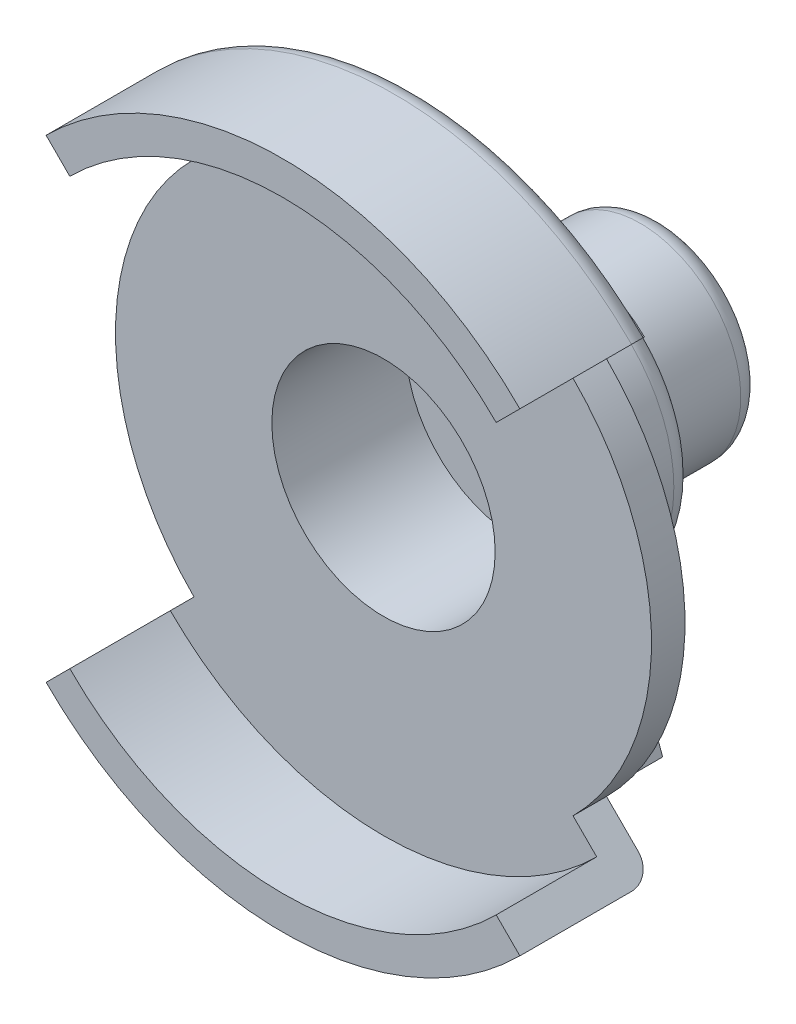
ISO-10303-21;
HEADER;
FILE_DESCRIPTION(('STEP AP214'),'2;1');
FILE_NAME('part.step','',(''),(''),'','','');
FILE_SCHEMA(('AUTOMOTIVE_DESIGN { 1 0 10303 214 1 1 1 1 }'));
ENDSEC;
DATA;
#1=APPLICATION_CONTEXT('core data for automotive mechanical design processes');
#2=APPLICATION_PROTOCOL_DEFINITION('international standard','automotive_design',2000,#1);
#3=PRODUCT_CONTEXT('',#1,'mechanical');
#4=PRODUCT('Part','Part','',(#3));
#5=PRODUCT_RELATED_PRODUCT_CATEGORY('part','',(#4));
#6=PRODUCT_DEFINITION_FORMATION('','',#4);
#7=PRODUCT_DEFINITION_CONTEXT('part definition',#1,'design');
#8=PRODUCT_DEFINITION('design','',#6,#7);
#9=PRODUCT_DEFINITION_SHAPE('','',#8);
#10=(LENGTH_UNIT() NAMED_UNIT(*) SI_UNIT(.MILLI.,.METRE.));
#11=(NAMED_UNIT(*) PLANE_ANGLE_UNIT() SI_UNIT($,.RADIAN.));
#12=(NAMED_UNIT(*) SI_UNIT($,.STERADIAN.) SOLID_ANGLE_UNIT());
#13=UNCERTAINTY_MEASURE_WITH_UNIT(LENGTH_MEASURE(1.E-05),#10,'distance_accuracy_value','');
#14=(GEOMETRIC_REPRESENTATION_CONTEXT(3) GLOBAL_UNCERTAINTY_ASSIGNED_CONTEXT((#13)) GLOBAL_UNIT_ASSIGNED_CONTEXT((#10,
#11,#12)) REPRESENTATION_CONTEXT('',''));
#15=CARTESIAN_POINT('',(0.,0.,0.));
#16=DIRECTION('',(0.,0.,1.));
#17=DIRECTION('',(1.,0.,0.));
#18=AXIS2_PLACEMENT_3D('',#15,#16,#17);
#19=CARTESIAN_POINT('',(0.,0.,-3.));
#20=DIRECTION('',(0.,0.,1.));
#21=DIRECTION('',(1.,0.,0.));
#22=AXIS2_PLACEMENT_3D('',#19,#20,#21);
#23=PLANE('',#22);
#24=CARTESIAN_POINT('',(0.,0.,-3.));
#25=DIRECTION('',(0.,0.,1.));
#26=DIRECTION('',(1.,0.,0.));
#27=AXIS2_PLACEMENT_3D('',#24,#25,#26);
#28=CIRCLE('',#27,6.5);
#29=CARTESIAN_POINT('',(6.5,0.,-3.));
#30=VERTEX_POINT('',#29);
#31=EDGE_CURVE('E389',#30,#30,#28,.F.);
#32=ORIENTED_EDGE('',*,*,#31,.F.);
#33=EDGE_LOOP('',(#32));
#34=FACE_BOUND('',#33,.T.);
#35=CARTESIAN_POINT('',(0.,0.,-3.));
#36=DIRECTION('',(0.,0.,1.));
#37=DIRECTION('',(1.,0.,0.));
#38=AXIS2_PLACEMENT_3D('',#35,#36,#37);
#39=CIRCLE('',#38,14.);
#40=CARTESIAN_POINT('',(-9.89949493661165,9.89949493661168,-3.));
#41=VERTEX_POINT('',#40);
#42=CARTESIAN_POINT('',(9.89949493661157,9.89949493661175,-3.));
#43=VERTEX_POINT('',#42);
#44=EDGE_CURVE('E409',#41,#43,#39,.F.);
#45=ORIENTED_EDGE('',*,*,#44,.T.);
#46=DIRECTION('',(0.707106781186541,0.707106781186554,0.));
#47=VECTOR('',#46,1.);
#48=CARTESIAN_POINT('',(8.48528137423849,8.48528137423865,-3.));
#49=LINE('',#48,#47);
#50=CARTESIAN_POINT('',(8.48528137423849,8.48528137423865,-3.));
#51=VERTEX_POINT('',#50);
#52=EDGE_CURVE('E258',#51,#43,#49,.T.);
#53=ORIENTED_EDGE('',*,*,#52,.F.);
#54=CARTESIAN_POINT('',(0.,0.,-3.));
#55=DIRECTION('',(0.,0.,1.));
#56=DIRECTION('',(1.,0.,0.));
#57=AXIS2_PLACEMENT_3D('',#54,#55,#56);
#58=CIRCLE('',#57,12.);
#59=CARTESIAN_POINT('',(8.48528137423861,-8.48528137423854,-3.));
#60=VERTEX_POINT('',#59);
#61=EDGE_CURVE('E255',#60,#51,#58,.T.);
#62=ORIENTED_EDGE('',*,*,#61,.F.);
#63=DIRECTION('',(-0.707106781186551,0.707106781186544,0.));
#64=VECTOR('',#63,1.);
#65=CARTESIAN_POINT('',(8.48528137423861,-8.48528137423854,-3.));
#66=LINE('',#65,#64);
#67=CARTESIAN_POINT('',(9.89949493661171,-9.89949493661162,-3.));
#68=VERTEX_POINT('',#67);
#69=EDGE_CURVE('E224',#68,#60,#66,.T.);
#70=ORIENTED_EDGE('',*,*,#69,.F.);
#71=CARTESIAN_POINT('',(-9.89949493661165,-9.89949493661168,-3.));
#72=VERTEX_POINT('',#71);
#73=EDGE_CURVE('E408',#68,#72,#39,.F.);
#74=ORIENTED_EDGE('',*,*,#73,.T.);
#75=DIRECTION('',(-0.707106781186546,-0.707106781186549,0.));
#76=VECTOR('',#75,1.);
#77=CARTESIAN_POINT('',(-8.48528137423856,-8.48528137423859,-3.));
#78=LINE('',#77,#76);
#79=CARTESIAN_POINT('',(-8.48528137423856,-8.4852813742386,-3.));
#80=VERTEX_POINT('',#79);
#81=EDGE_CURVE('E288',#80,#72,#78,.T.);
#82=ORIENTED_EDGE('',*,*,#81,.F.);
#83=CARTESIAN_POINT('',(0.,0.,-3.));
#84=DIRECTION('',(0.,0.,1.));
#85=DIRECTION('',(-1.,0.,0.));
#86=AXIS2_PLACEMENT_3D('',#83,#84,#85);
#87=CIRCLE('',#86,12.);
#88=CARTESIAN_POINT('',(-8.48528137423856,8.48528137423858,-3.));
#89=VERTEX_POINT('',#88);
#90=EDGE_CURVE('E285',#89,#80,#87,.T.);
#91=ORIENTED_EDGE('',*,*,#90,.F.);
#92=DIRECTION('',(0.707106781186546,-0.707106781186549,0.));
#93=VECTOR('',#92,1.);
#94=CARTESIAN_POINT('',(-8.48528137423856,8.48528137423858,-3.));
#95=LINE('',#94,#93);
#96=EDGE_CURVE('E282',#41,#89,#95,.T.);
#97=ORIENTED_EDGE('',*,*,#96,.F.);
#98=EDGE_LOOP('',(#45,#53,#62,#70,#74,#82,#91,#97));
#99=FACE_BOUND('',#98,.T.);
#100=CARTESIAN_POINT('',(0.,0.,-3.));
#101=DIRECTION('',(0.,0.,-1.));
#102=DIRECTION('',(-1.,0.,0.));
#103=AXIS2_PLACEMENT_3D('',#100,#101,#102);
#104=CIRCLE('',#103,13.);
#105=CARTESIAN_POINT('',(4.49999999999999,-12.1963109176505,-3.));
#106=VERTEX_POINT('',#105);
#107=CARTESIAN_POINT('',(-4.50000000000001,-12.1963109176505,-3.));
#108=VERTEX_POINT('',#107);
#109=EDGE_CURVE('E228',#106,#108,#104,.T.);
#110=ORIENTED_EDGE('',*,*,#109,.F.);
#111=DIRECTION('',(-0.346153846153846,0.93817776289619,0.));
#112=VECTOR('',#111,1.);
#113=CARTESIAN_POINT('',(4.49999999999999,-12.1963109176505,-3.));
#114=LINE('',#113,#112);
#115=CARTESIAN_POINT('',(3.8076923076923,-10.3199553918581,-3.));
#116=VERTEX_POINT('',#115);
#117=EDGE_CURVE('E236',#106,#116,#114,.T.);
#118=ORIENTED_EDGE('',*,*,#117,.T.);
#119=CARTESIAN_POINT('',(0.,0.,-3.));
#120=DIRECTION('',(0.,0.,-1.));
#121=DIRECTION('',(-1.,0.,0.));
#122=AXIS2_PLACEMENT_3D('',#119,#120,#121);
#123=CIRCLE('',#122,11.);
#124=CARTESIAN_POINT('',(-3.80769230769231,-10.3199553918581,-3.));
#125=VERTEX_POINT('',#124);
#126=EDGE_CURVE('E50',#116,#125,#123,.T.);
#127=ORIENTED_EDGE('',*,*,#126,.T.);
#128=DIRECTION('',(-0.346153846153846,-0.93817776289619,0.));
#129=VECTOR('',#128,1.);
#130=CARTESIAN_POINT('',(-3.80769230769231,-10.3199553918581,-3.));
#131=LINE('',#130,#129);
#132=EDGE_CURVE('E219',#125,#108,#131,.T.);
#133=ORIENTED_EDGE('',*,*,#132,.T.);
#134=EDGE_LOOP('',(#110,#118,#127,#133));
#135=FACE_BOUND('',#134,.T.);
#136=ADVANCED_FACE('F35',(#34,#99,#135),#23,.F.);
#137=CARTESIAN_POINT('',(0.,0.,3.));
#138=DIRECTION('',(0.,0.,-1.));
#139=DIRECTION('',(-1.,0.,0.));
#140=AXIS2_PLACEMENT_3D('',#137,#138,#139);
#141=CYLINDRICAL_SURFACE('',#140,15.);
#142=CARTESIAN_POINT('',(0.,0.,3.));
#143=DIRECTION('',(0.,0.,1.));
#144=DIRECTION('',(1.,0.,0.));
#145=AXIS2_PLACEMENT_3D('',#142,#143,#144);
#146=CIRCLE('',#145,15.);
#147=CARTESIAN_POINT('',(10.6066017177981,10.6066017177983,3.));
#148=VERTEX_POINT('',#147);
#149=CARTESIAN_POINT('',(-10.6066017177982,10.6066017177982,3.));
#150=VERTEX_POINT('',#149);
#151=EDGE_CURVE('E385',#148,#150,#146,.T.);
#152=ORIENTED_EDGE('',*,*,#151,.F.);
#153=DIRECTION('',(0.,0.,-1.));
#154=VECTOR('',#153,1.);
#155=CARTESIAN_POINT('',(10.6066017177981,10.6066017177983,3.));
#156=LINE('',#155,#154);
#157=CARTESIAN_POINT('',(10.6066017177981,10.6066017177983,-2.));
#158=VERTEX_POINT('',#157);
#159=EDGE_CURVE('E267',#148,#158,#156,.T.);
#160=ORIENTED_EDGE('',*,*,#159,.T.);
#161=CARTESIAN_POINT('',(0.,0.,-2.));
#162=DIRECTION('',(0.,0.,1.));
#163=DIRECTION('',(1.,0.,0.));
#164=AXIS2_PLACEMENT_3D('',#161,#162,#163);
#165=CIRCLE('',#164,15.);
#166=CARTESIAN_POINT('',(-10.6066017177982,10.6066017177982,-2.));
#167=VERTEX_POINT('',#166);
#168=EDGE_CURVE('E404',#158,#167,#165,.T.);
#169=ORIENTED_EDGE('',*,*,#168,.T.);
#170=DIRECTION('',(0.,0.,-1.));
#171=VECTOR('',#170,1.);
#172=CARTESIAN_POINT('',(-10.6066017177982,10.6066017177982,3.));
#173=LINE('',#172,#171);
#174=EDGE_CURVE('E297',#150,#167,#173,.T.);
#175=ORIENTED_EDGE('',*,*,#174,.F.);
#176=EDGE_LOOP('',(#152,#160,#169,#175));
#177=FACE_BOUND('',#176,.T.);
#178=ADVANCED_FACE('F454',(#177),#141,.T.);
#179=CARTESIAN_POINT('',(0.,0.,3.));
#180=DIRECTION('',(0.,0.,1.));
#181=DIRECTION('',(1.,0.,0.));
#182=AXIS2_PLACEMENT_3D('',#179,#180,#181);
#183=PLANE('',#182);
#184=DIRECTION('',(0.707106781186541,0.707106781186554,0.));
#185=VECTOR('',#184,1.);
#186=CARTESIAN_POINT('',(8.48528137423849,8.48528137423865,3.));
#187=LINE('',#186,#185);
#188=CARTESIAN_POINT('',(9.54594154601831,9.54594154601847,3.));
#189=VERTEX_POINT('',#188);
#190=EDGE_CURVE('E263',#189,#148,#187,.T.);
#191=ORIENTED_EDGE('',*,*,#190,.T.);
#192=ORIENTED_EDGE('',*,*,#151,.T.);
#193=DIRECTION('',(0.707106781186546,-0.707106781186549,0.));
#194=VECTOR('',#193,1.);
#195=CARTESIAN_POINT('',(-8.48528137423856,8.48528137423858,3.));
#196=LINE('',#195,#194);
#197=CARTESIAN_POINT('',(-9.54594154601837,9.54594154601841,3.));
#198=VERTEX_POINT('',#197);
#199=EDGE_CURVE('E291',#150,#198,#196,.T.);
#200=ORIENTED_EDGE('',*,*,#199,.T.);
#201=CARTESIAN_POINT('',(0.,0.,3.));
#202=DIRECTION('',(0.,0.,1.));
#203=DIRECTION('',(1.,0.,0.));
#204=AXIS2_PLACEMENT_3D('',#201,#202,#203);
#205=CIRCLE('',#204,13.5);
#206=EDGE_CURVE('E373',#189,#198,#205,.T.);
#207=ORIENTED_EDGE('',*,*,#206,.F.);
#208=EDGE_LOOP('',(#191,#192,#200,#207));
#209=FACE_BOUND('',#208,.T.);
#210=ADVANCED_FACE('F451',(#209),#183,.T.);
#211=CARTESIAN_POINT('',(0.,0.,-2.));
#212=DIRECTION('',(0.,0.,1.));
#213=DIRECTION('',(1.,0.,0.));
#214=AXIS2_PLACEMENT_3D('',#211,#212,#213);
#215=TOROIDAL_SURFACE('',#214,14.,1.);
#216=CARTESIAN_POINT('',(9.89949493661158,9.89949493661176,-2.));
#217=DIRECTION('',(-0.707106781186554,0.707106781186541,0.));
#218=DIRECTION('',(-0.707106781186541,-0.707106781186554,0.));
#219=AXIS2_PLACEMENT_3D('',#216,#217,#218);
#220=CIRCLE('',#219,1.);
#221=EDGE_CURVE('E280',#43,#158,#220,.F.);
#222=ORIENTED_EDGE('',*,*,#221,.F.);
#223=ORIENTED_EDGE('',*,*,#44,.F.);
#224=CARTESIAN_POINT('',(-9.89949493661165,9.89949493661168,-2.));
#225=DIRECTION('',(0.707106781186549,0.707106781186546,0.));
#226=DIRECTION('',(-0.707106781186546,0.707106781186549,0.));
#227=AXIS2_PLACEMENT_3D('',#224,#225,#226);
#228=CIRCLE('',#227,1.);
#229=EDGE_CURVE('E310',#167,#41,#228,.F.);
#230=ORIENTED_EDGE('',*,*,#229,.F.);
#231=ORIENTED_EDGE('',*,*,#168,.F.);
#232=EDGE_LOOP('',(#222,#223,#230,#231));
#233=FACE_BOUND('',#232,.T.);
#234=ADVANCED_FACE('F461',(#233),#215,.T.);
#235=CARTESIAN_POINT('',(0.,0.,3.));
#236=DIRECTION('',(0.,0.,-1.));
#237=DIRECTION('',(-1.,0.,0.));
#238=AXIS2_PLACEMENT_3D('',#235,#236,#237);
#239=CYLINDRICAL_SURFACE('',#238,13.5);
#240=DIRECTION('',(0.,0.,-1.));
#241=VECTOR('',#240,1.);
#242=CARTESIAN_POINT('',(9.54594154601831,9.54594154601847,3.));
#243=LINE('',#242,#241);
#244=CARTESIAN_POINT('',(9.54594154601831,9.54594154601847,-1.5));
#245=VERTEX_POINT('',#244);
#246=EDGE_CURVE('E43',#189,#245,#243,.T.);
#247=ORIENTED_EDGE('',*,*,#246,.F.);
#248=ORIENTED_EDGE('',*,*,#206,.T.);
#249=DIRECTION('',(0.,0.,-1.));
#250=VECTOR('',#249,1.);
#251=CARTESIAN_POINT('',(-9.54594154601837,9.54594154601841,3.));
#252=LINE('',#251,#250);
#253=CARTESIAN_POINT('',(-9.54594154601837,9.54594154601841,-1.5));
#254=VERTEX_POINT('',#253);
#255=EDGE_CURVE('E422',#254,#198,#252,.F.);
#256=ORIENTED_EDGE('',*,*,#255,.F.);
#257=CARTESIAN_POINT('',(0.,0.,-1.5));
#258=DIRECTION('',(0.,0.,1.));
#259=DIRECTION('',(1.,0.,0.));
#260=AXIS2_PLACEMENT_3D('',#257,#258,#259);
#261=CIRCLE('',#260,13.5);
#262=EDGE_CURVE('E369',#245,#254,#261,.T.);
#263=ORIENTED_EDGE('',*,*,#262,.F.);
#264=EDGE_LOOP('',(#247,#248,#256,#263));
#265=FACE_BOUND('',#264,.T.);
#266=ADVANCED_FACE('F444',(#265),#239,.F.);
#267=CARTESIAN_POINT('',(0.,0.,-8.99999999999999));
#268=DIRECTION('',(0.,0.,-1.));
#269=DIRECTION('',(-1.,0.,0.));
#270=AXIS2_PLACEMENT_3D('',#267,#268,#269);
#271=PLANE('',#270);
#272=DIRECTION('',(-0.707106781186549,-0.707106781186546,0.));
#273=VECTOR('',#272,1.);
#274=CARTESIAN_POINT('',(0.,0.,-8.99999999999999));
#275=LINE('',#274,#273);
#276=CARTESIAN_POINT('',(3.88908729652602,3.889087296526,-8.99999999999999));
#277=VERTEX_POINT('',#276);
#278=CARTESIAN_POINT('',(3.18198051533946,3.18198051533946,-8.99999999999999));
#279=VERTEX_POINT('',#278);
#280=EDGE_CURVE('E357',#277,#279,#275,.T.);
#281=ORIENTED_EDGE('',*,*,#280,.F.);
#282=CARTESIAN_POINT('',(0.,0.,-8.99999999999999));
#283=DIRECTION('',(0.,0.,-1.));
#284=DIRECTION('',(-1.,0.,0.));
#285=AXIS2_PLACEMENT_3D('',#282,#283,#284);
#286=CIRCLE('',#285,5.5);
#287=CARTESIAN_POINT('',(-3.88908729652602,3.889087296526,-8.99999999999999));
#288=VERTEX_POINT('',#287);
#289=EDGE_CURVE('E398',#277,#288,#286,.T.);
#290=ORIENTED_EDGE('',*,*,#289,.T.);
#291=DIRECTION('',(-0.707106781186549,0.707106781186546,0.));
#292=VECTOR('',#291,1.);
#293=CARTESIAN_POINT('',(0.,0.,-8.99999999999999));
#294=LINE('',#293,#292);
#295=CARTESIAN_POINT('',(-3.18198051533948,3.18198051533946,-8.99999999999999));
#296=VERTEX_POINT('',#295);
#297=EDGE_CURVE('E345',#296,#288,#294,.T.);
#298=ORIENTED_EDGE('',*,*,#297,.F.);
#299=CARTESIAN_POINT('',(0.,0.,-8.99999999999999));
#300=DIRECTION('',(0.,0.,-1.));
#301=DIRECTION('',(-1.,0.,0.));
#302=AXIS2_PLACEMENT_3D('',#299,#300,#301);
#303=CIRCLE('',#302,4.5);
#304=EDGE_CURVE('E380',#279,#296,#303,.T.);
#305=ORIENTED_EDGE('',*,*,#304,.F.);
#306=EDGE_LOOP('',(#281,#290,#298,#305));
#307=FACE_BOUND('',#306,.T.);
#308=ADVANCED_FACE('F519',(#307),#271,.T.);
#309=CARTESIAN_POINT('',(-10.6066017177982,-10.6066017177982,-2.));
#310=VERTEX_POINT('',#309);
#311=CARTESIAN_POINT('',(10.6066017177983,-10.6066017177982,-2.));
#312=VERTEX_POINT('',#311);
#313=EDGE_CURVE('E405',#310,#312,#165,.T.);
#314=ORIENTED_EDGE('',*,*,#313,.T.);
#315=DIRECTION('',(0.,0.,-1.));
#316=VECTOR('',#315,1.);
#317=CARTESIAN_POINT('',(10.6066017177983,-10.6066017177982,3.));
#318=LINE('',#317,#316);
#319=CARTESIAN_POINT('',(10.6066017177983,-10.6066017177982,3.));
#320=VERTEX_POINT('',#319);
#321=EDGE_CURVE('E266',#320,#312,#318,.T.);
#322=ORIENTED_EDGE('',*,*,#321,.F.);
#323=CARTESIAN_POINT('',(-10.6066017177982,-10.6066017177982,3.));
#324=VERTEX_POINT('',#323);
#325=EDGE_CURVE('E386',#324,#320,#146,.T.);
#326=ORIENTED_EDGE('',*,*,#325,.F.);
#327=DIRECTION('',(0.,0.,-1.));
#328=VECTOR('',#327,1.);
#329=CARTESIAN_POINT('',(-10.6066017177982,-10.6066017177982,3.));
#330=LINE('',#329,#328);
#331=EDGE_CURVE('E298',#324,#310,#330,.T.);
#332=ORIENTED_EDGE('',*,*,#331,.T.);
#333=EDGE_LOOP('',(#314,#322,#326,#332));
#334=FACE_BOUND('',#333,.T.);
#335=ADVANCED_FACE('F37',(#334),#141,.T.);
#336=DIRECTION('',(-0.707106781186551,0.707106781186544,0.));
#337=VECTOR('',#336,1.);
#338=CARTESIAN_POINT('',(8.48528137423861,-8.48528137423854,3.));
#339=LINE('',#338,#337);
#340=CARTESIAN_POINT('',(9.54594154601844,-9.54594154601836,3.));
#341=VERTEX_POINT('',#340);
#342=EDGE_CURVE('E260',#320,#341,#339,.T.);
#343=ORIENTED_EDGE('',*,*,#342,.T.);
#344=CARTESIAN_POINT('',(-9.54594154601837,-9.54594154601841,3.));
#345=VERTEX_POINT('',#344);
#346=EDGE_CURVE('E376',#345,#341,#205,.T.);
#347=ORIENTED_EDGE('',*,*,#346,.F.);
#348=DIRECTION('',(-0.707106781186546,-0.707106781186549,0.));
#349=VECTOR('',#348,1.);
#350=CARTESIAN_POINT('',(-8.48528137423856,-8.48528137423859,3.));
#351=LINE('',#350,#349);
#352=EDGE_CURVE('E294',#345,#324,#351,.T.);
#353=ORIENTED_EDGE('',*,*,#352,.T.);
#354=ORIENTED_EDGE('',*,*,#325,.T.);
#355=EDGE_LOOP('',(#343,#347,#353,#354));
#356=FACE_BOUND('',#355,.T.);
#357=ADVANCED_FACE('F481',(#356),#183,.T.);
#358=CARTESIAN_POINT('',(0.,0.,-8.99999999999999));
#359=DIRECTION('',(0.,0.,1.));
#360=DIRECTION('',(1.,0.,0.));
#361=AXIS2_PLACEMENT_3D('',#358,#359,#360);
#362=CYLINDRICAL_SURFACE('',#361,6.5);
#363=CARTESIAN_POINT('',(0.,0.,-7.99999999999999));
#364=DIRECTION('',(0.,0.,-1.));
#365=DIRECTION('',(-1.,0.,0.));
#366=AXIS2_PLACEMENT_3D('',#363,#364,#365);
#367=CIRCLE('',#366,6.5);
#368=CARTESIAN_POINT('',(-4.59619407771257,4.59619407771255,-7.99999999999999));
#369=VERTEX_POINT('',#368);
#370=CARTESIAN_POINT('',(4.59619407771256,4.59619407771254,-7.99999999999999));
#371=VERTEX_POINT('',#370);
#372=EDGE_CURVE('E401',#369,#371,#367,.F.);
#373=ORIENTED_EDGE('',*,*,#372,.T.);
#374=DIRECTION('',(0.,0.,-1.));
#375=VECTOR('',#374,1.);
#376=CARTESIAN_POINT('',(4.59619407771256,4.59619407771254,-4.));
#377=LINE('',#376,#375);
#378=CARTESIAN_POINT('',(4.59619407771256,4.59619407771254,-4.));
#379=VERTEX_POINT('',#378);
#380=EDGE_CURVE('E331',#379,#371,#377,.T.);
#381=ORIENTED_EDGE('',*,*,#380,.F.);
#382=CARTESIAN_POINT('',(0.,0.,-4.));
#383=DIRECTION('',(0.,0.,-1.));
#384=DIRECTION('',(-1.,0.,0.));
#385=AXIS2_PLACEMENT_3D('',#382,#383,#384);
#386=CIRCLE('',#385,6.5);
#387=CARTESIAN_POINT('',(-4.59619407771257,4.59619407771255,-4.));
#388=VERTEX_POINT('',#387);
#389=EDGE_CURVE('E327',#388,#379,#386,.T.);
#390=ORIENTED_EDGE('',*,*,#389,.F.);
#391=DIRECTION('',(0.,0.,-1.));
#392=VECTOR('',#391,1.);
#393=CARTESIAN_POINT('',(-4.59619407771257,4.59619407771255,-4.));
#394=LINE('',#393,#392);
#395=EDGE_CURVE('E330',#388,#369,#394,.T.);
#396=ORIENTED_EDGE('',*,*,#395,.T.);
#397=EDGE_LOOP('',(#373,#381,#390,#396));
#398=FACE_BOUND('',#397,.T.);
#399=ORIENTED_EDGE('',*,*,#31,.T.);
#400=EDGE_LOOP('',(#399));
#401=FACE_BOUND('',#400,.T.);
#402=ADVANCED_FACE('F510',(#398,#401),#362,.T.);
#403=CARTESIAN_POINT('',(0.,0.,-14.));
#404=DIRECTION('',(0.,0.,1.));
#405=DIRECTION('',(1.,0.,0.));
#406=AXIS2_PLACEMENT_3D('',#403,#404,#405);
#407=CYLINDRICAL_SURFACE('',#406,4.5);
#408=CARTESIAN_POINT('',(0.,0.,-13.));
#409=DIRECTION('',(0.,0.,-1.));
#410=DIRECTION('',(-1.,0.,0.));
#411=AXIS2_PLACEMENT_3D('',#408,#409,#410);
#412=CIRCLE('',#411,4.5);
#413=CARTESIAN_POINT('',(-4.5,0.,-13.));
#414=VERTEX_POINT('',#413);
#415=EDGE_CURVE('E395',#414,#414,#412,.F.);
#416=ORIENTED_EDGE('',*,*,#415,.T.);
#417=EDGE_LOOP('',(#416));
#418=FACE_BOUND('',#417,.T.);
#419=CARTESIAN_POINT('',(0.,0.,-9.99999999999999));
#420=DIRECTION('',(0.,0.,-1.));
#421=DIRECTION('',(-1.,0.,0.));
#422=AXIS2_PLACEMENT_3D('',#419,#420,#421);
#423=CIRCLE('',#422,4.5);
#424=CARTESIAN_POINT('',(-3.18198051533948,3.18198051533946,-9.99999999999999));
#425=VERTEX_POINT('',#424);
#426=CARTESIAN_POINT('',(3.18198051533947,3.18198051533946,-9.99999999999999));
#427=VERTEX_POINT('',#426);
#428=EDGE_CURVE('E333',#425,#427,#423,.T.);
#429=ORIENTED_EDGE('',*,*,#428,.T.);
#430=DIRECTION('',(0.,0.,1.));
#431=VECTOR('',#430,1.);
#432=CARTESIAN_POINT('',(3.18198051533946,3.18198051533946,-14.));
#433=LINE('',#432,#431);
#434=EDGE_CURVE('E359',#427,#279,#433,.T.);
#435=ORIENTED_EDGE('',*,*,#434,.T.);
#436=ORIENTED_EDGE('',*,*,#304,.T.);
#437=DIRECTION('',(0.,0.,1.));
#438=VECTOR('',#437,1.);
#439=CARTESIAN_POINT('',(-3.18198051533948,3.18198051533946,-14.));
#440=LINE('',#439,#438);
#441=EDGE_CURVE('E347',#296,#425,#440,.F.);
#442=ORIENTED_EDGE('',*,*,#441,.T.);
#443=EDGE_LOOP('',(#429,#435,#436,#442));
#444=FACE_BOUND('',#443,.T.);
#445=ADVANCED_FACE('F517',(#418,#444),#407,.T.);
#446=CARTESIAN_POINT('',(0.,0.,-14.));
#447=DIRECTION('',(0.,0.,-1.));
#448=DIRECTION('',(-1.,0.,0.));
#449=AXIS2_PLACEMENT_3D('',#446,#447,#448);
#450=PLANE('',#449);
#451=CARTESIAN_POINT('',(0.,0.,-14.));
#452=DIRECTION('',(0.,0.,-1.));
#453=DIRECTION('',(-1.,0.,0.));
#454=AXIS2_PLACEMENT_3D('',#451,#452,#453);
#455=CIRCLE('',#454,3.);
#456=CARTESIAN_POINT('',(-3.,0.,-14.));
#457=VERTEX_POINT('',#456);
#458=EDGE_CURVE('E362',#457,#457,#455,.T.);
#459=ORIENTED_EDGE('',*,*,#458,.F.);
#460=EDGE_LOOP('',(#459));
#461=FACE_BOUND('',#460,.T.);
#462=CARTESIAN_POINT('',(0.,0.,-14.));
#463=DIRECTION('',(0.,0.,-1.));
#464=DIRECTION('',(-1.,0.,0.));
#465=AXIS2_PLACEMENT_3D('',#462,#463,#464);
#466=CIRCLE('',#465,3.5);
#467=CARTESIAN_POINT('',(-3.5,0.,-14.));
#468=VERTEX_POINT('',#467);
#469=EDGE_CURVE('E392',#468,#468,#466,.T.);
#470=ORIENTED_EDGE('',*,*,#469,.T.);
#471=EDGE_LOOP('',(#470));
#472=FACE_BOUND('',#471,.T.);
#473=ADVANCED_FACE('F545',(#461,#472),#450,.T.);
#474=CARTESIAN_POINT('',(0.,0.,-13.));
#475=DIRECTION('',(0.,0.,-1.));
#476=DIRECTION('',(-1.,0.,0.));
#477=AXIS2_PLACEMENT_3D('',#474,#475,#476);
#478=TOROIDAL_SURFACE('',#477,3.5,1.);
#479=ORIENTED_EDGE('',*,*,#415,.F.);
#480=EDGE_LOOP('',(#479));
#481=FACE_BOUND('',#480,.T.);
#482=ORIENTED_EDGE('',*,*,#469,.F.);
#483=EDGE_LOOP('',(#482));
#484=FACE_BOUND('',#483,.T.);
#485=ADVANCED_FACE('F540',(#481,#484),#478,.T.);
#486=CARTESIAN_POINT('',(0.,0.,-7.99999999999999));
#487=DIRECTION('',(0.,0.,-1.));
#488=DIRECTION('',(-1.,0.,0.));
#489=AXIS2_PLACEMENT_3D('',#486,#487,#488);
#490=TOROIDAL_SURFACE('',#489,5.5,1.);
#491=CARTESIAN_POINT('',(3.88908729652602,3.889087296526,-7.99999999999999));
#492=DIRECTION('',(0.707106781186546,-0.707106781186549,0.));
#493=DIRECTION('',(0.707106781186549,0.707106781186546,0.));
#494=AXIS2_PLACEMENT_3D('',#491,#492,#493);
#495=CIRCLE('',#494,1.);
#496=EDGE_CURVE('E355',#371,#277,#495,.F.);
#497=ORIENTED_EDGE('',*,*,#496,.F.);
#498=ORIENTED_EDGE('',*,*,#372,.F.);
#499=CARTESIAN_POINT('',(-3.88908729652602,3.889087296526,-7.99999999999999));
#500=DIRECTION('',(-0.707106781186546,-0.707106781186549,0.));
#501=DIRECTION('',(0.707106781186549,-0.707106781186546,0.));
#502=AXIS2_PLACEMENT_3D('',#499,#500,#501);
#503=CIRCLE('',#502,1.);
#504=EDGE_CURVE('E343',#288,#369,#503,.F.);
#505=ORIENTED_EDGE('',*,*,#504,.F.);
#506=ORIENTED_EDGE('',*,*,#289,.F.);
#507=EDGE_LOOP('',(#497,#498,#505,#506));
#508=FACE_BOUND('',#507,.T.);
#509=ADVANCED_FACE('F533',(#508),#490,.T.);
#510=CARTESIAN_POINT('',(9.89949493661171,-9.89949493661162,-2.));
#511=DIRECTION('',(-0.707106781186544,-0.707106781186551,0.));
#512=DIRECTION('',(0.707106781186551,-0.707106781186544,0.));
#513=AXIS2_PLACEMENT_3D('',#510,#511,#512);
#514=CIRCLE('',#513,1.);
#515=EDGE_CURVE('E276',#312,#68,#514,.F.);
#516=ORIENTED_EDGE('',*,*,#515,.F.);
#517=ORIENTED_EDGE('',*,*,#313,.F.);
#518=CARTESIAN_POINT('',(-9.89949493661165,-9.89949493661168,-2.));
#519=DIRECTION('',(0.707106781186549,-0.707106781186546,0.));
#520=DIRECTION('',(0.707106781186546,0.707106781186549,0.));
#521=AXIS2_PLACEMENT_3D('',#518,#519,#520);
#522=CIRCLE('',#521,1.);
#523=EDGE_CURVE('E314',#72,#310,#522,.F.);
#524=ORIENTED_EDGE('',*,*,#523,.F.);
#525=ORIENTED_EDGE('',*,*,#73,.F.);
#526=EDGE_LOOP('',(#516,#517,#524,#525));
#527=FACE_BOUND('',#526,.T.);
#528=ADVANCED_FACE('F489',(#527),#215,.T.);
#529=CARTESIAN_POINT('',(0.,0.,-7.50000000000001));
#530=DIRECTION('',(0.,0.,-1.));
#531=DIRECTION('',(-1.,0.,0.));
#532=AXIS2_PLACEMENT_3D('',#529,#530,#531);
#533=PLANE('',#532);
#534=CARTESIAN_POINT('',(0.,0.,-7.50000000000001));
#535=DIRECTION('',(0.,0.,-1.));
#536=DIRECTION('',(-1.,0.,0.));
#537=AXIS2_PLACEMENT_3D('',#534,#535,#536);
#538=CIRCLE('',#537,5.);
#539=CARTESIAN_POINT('',(3.53553390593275,3.53553390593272,-7.50000000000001));
#540=VERTEX_POINT('',#539);
#541=CARTESIAN_POINT('',(-3.53553390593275,3.53553390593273,-7.50000000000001));
#542=VERTEX_POINT('',#541);
#543=EDGE_CURVE('E366',#540,#542,#538,.T.);
#544=ORIENTED_EDGE('',*,*,#543,.F.);
#545=DIRECTION('',(-0.707106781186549,-0.707106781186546,0.));
#546=VECTOR('',#545,1.);
#547=CARTESIAN_POINT('',(0.,0.,-7.50000000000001));
#548=LINE('',#547,#546);
#549=CARTESIAN_POINT('',(2.12132034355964,2.12132034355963,-7.50000000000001));
#550=VERTEX_POINT('',#549);
#551=EDGE_CURVE('E350',#540,#550,#548,.T.);
#552=ORIENTED_EDGE('',*,*,#551,.T.);
#553=CARTESIAN_POINT('',(0.,0.,-7.50000000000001));
#554=DIRECTION('',(0.,0.,-1.));
#555=DIRECTION('',(-1.,0.,0.));
#556=AXIS2_PLACEMENT_3D('',#553,#554,#555);
#557=CIRCLE('',#556,3.);
#558=CARTESIAN_POINT('',(-2.12132034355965,2.12132034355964,-7.50000000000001));
#559=VERTEX_POINT('',#558);
#560=EDGE_CURVE('E365',#550,#559,#557,.T.);
#561=ORIENTED_EDGE('',*,*,#560,.T.);
#562=DIRECTION('',(-0.707106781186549,0.707106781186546,0.));
#563=VECTOR('',#562,1.);
#564=CARTESIAN_POINT('',(0.,0.,-7.50000000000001));
#565=LINE('',#564,#563);
#566=EDGE_CURVE('E338',#559,#542,#565,.T.);
#567=ORIENTED_EDGE('',*,*,#566,.T.);
#568=EDGE_LOOP('',(#544,#552,#561,#567));
#569=FACE_BOUND('',#568,.T.);
#570=ADVANCED_FACE('F532',(#569),#533,.F.);
#571=CARTESIAN_POINT('',(0.,0.,-1.5));
#572=DIRECTION('',(0.,0.,1.));
#573=DIRECTION('',(1.,0.,0.));
#574=AXIS2_PLACEMENT_3D('',#571,#572,#573);
#575=PLANE('',#574);
#576=DIRECTION('',(-0.707106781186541,-0.707106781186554,0.));
#577=VECTOR('',#576,1.);
#578=CARTESIAN_POINT('',(0.,0.,-1.5));
#579=LINE('',#578,#577);
#580=CARTESIAN_POINT('',(8.48528137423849,8.48528137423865,-1.5));
#581=VERTEX_POINT('',#580);
#582=EDGE_CURVE('E278',#245,#581,#579,.T.);
#583=ORIENTED_EDGE('',*,*,#582,.F.);
#584=ORIENTED_EDGE('',*,*,#262,.T.);
#585=DIRECTION('',(-0.707106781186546,0.707106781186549,0.));
#586=VECTOR('',#585,1.);
#587=CARTESIAN_POINT('',(0.,0.,-1.5));
#588=LINE('',#587,#586);
#589=CARTESIAN_POINT('',(-8.48528137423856,8.48528137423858,-1.5));
#590=VERTEX_POINT('',#589);
#591=EDGE_CURVE('E301',#590,#254,#588,.T.);
#592=ORIENTED_EDGE('',*,*,#591,.F.);
#593=CARTESIAN_POINT('',(0.,0.,-1.5));
#594=DIRECTION('',(0.,0.,1.));
#595=DIRECTION('',(1.,0.,0.));
#596=AXIS2_PLACEMENT_3D('',#593,#594,#595);
#597=CIRCLE('',#596,12.);
#598=CARTESIAN_POINT('',(-8.48528137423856,-8.4852813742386,-1.5));
#599=VERTEX_POINT('',#598);
#600=EDGE_CURVE('E427',#599,#590,#597,.F.);
#601=ORIENTED_EDGE('',*,*,#600,.F.);
#602=DIRECTION('',(0.707106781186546,0.707106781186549,0.));
#603=VECTOR('',#602,1.);
#604=CARTESIAN_POINT('',(0.,0.,-1.5));
#605=LINE('',#604,#603);
#606=CARTESIAN_POINT('',(-9.54594154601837,-9.54594154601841,-1.5));
#607=VERTEX_POINT('',#606);
#608=EDGE_CURVE('E312',#607,#599,#605,.T.);
#609=ORIENTED_EDGE('',*,*,#608,.F.);
#610=CARTESIAN_POINT('',(9.54594154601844,-9.54594154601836,-1.5));
#611=VERTEX_POINT('',#610);
#612=EDGE_CURVE('E377',#607,#611,#261,.T.);
#613=ORIENTED_EDGE('',*,*,#612,.T.);
#614=DIRECTION('',(0.707106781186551,-0.707106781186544,0.));
#615=VECTOR('',#614,1.);
#616=CARTESIAN_POINT('',(0.,0.,-1.5));
#617=LINE('',#616,#615);
#618=CARTESIAN_POINT('',(8.48528137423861,-8.48528137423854,-1.5));
#619=VERTEX_POINT('',#618);
#620=EDGE_CURVE('E58',#619,#611,#617,.T.);
#621=ORIENTED_EDGE('',*,*,#620,.F.);
#622=CARTESIAN_POINT('',(0.,0.,-1.5));
#623=DIRECTION('',(0.,0.,1.));
#624=DIRECTION('',(1.,0.,0.));
#625=AXIS2_PLACEMENT_3D('',#622,#623,#624);
#626=CIRCLE('',#625,12.);
#627=EDGE_CURVE('E11',#581,#619,#626,.F.);
#628=ORIENTED_EDGE('',*,*,#627,.F.);
#629=EDGE_LOOP('',(#583,#584,#592,#601,#609,#613,#621,#628));
#630=FACE_BOUND('',#629,.T.);
#631=CARTESIAN_POINT('',(0.,0.,-1.5));
#632=DIRECTION('',(0.,0.,1.));
#633=DIRECTION('',(1.,0.,0.));
#634=AXIS2_PLACEMENT_3D('',#631,#632,#633);
#635=CIRCLE('',#634,5.);
#636=CARTESIAN_POINT('',(5.,0.,-1.5));
#637=VERTEX_POINT('',#636);
#638=EDGE_CURVE('E370',#637,#637,#635,.F.);
#639=ORIENTED_EDGE('',*,*,#638,.T.);
#640=EDGE_LOOP('',(#639));
#641=FACE_BOUND('',#640,.T.);
#642=ADVANCED_FACE('F440',(#630,#641),#575,.T.);
#643=DIRECTION('',(0.,0.,-1.));
#644=VECTOR('',#643,1.);
#645=CARTESIAN_POINT('',(9.54594154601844,-9.54594154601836,3.));
#646=LINE('',#645,#644);
#647=EDGE_CURVE('E429',#611,#341,#646,.F.);
#648=ORIENTED_EDGE('',*,*,#647,.F.);
#649=ORIENTED_EDGE('',*,*,#612,.F.);
#650=DIRECTION('',(0.,0.,-1.));
#651=VECTOR('',#650,1.);
#652=CARTESIAN_POINT('',(-9.54594154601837,-9.54594154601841,3.));
#653=LINE('',#652,#651);
#654=EDGE_CURVE('E425',#345,#607,#653,.T.);
#655=ORIENTED_EDGE('',*,*,#654,.F.);
#656=ORIENTED_EDGE('',*,*,#346,.T.);
#657=EDGE_LOOP('',(#648,#649,#655,#656));
#658=FACE_BOUND('',#657,.T.);
#659=ADVANCED_FACE('F479',(#658),#239,.F.);
#660=CARTESIAN_POINT('',(0.,0.,-8.99999999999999));
#661=DIRECTION('',(0.,0.,1.));
#662=DIRECTION('',(1.,0.,0.));
#663=AXIS2_PLACEMENT_3D('',#660,#661,#662);
#664=CYLINDRICAL_SURFACE('',#663,5.);
#665=DIRECTION('',(0.,0.,1.));
#666=VECTOR('',#665,1.);
#667=CARTESIAN_POINT('',(3.53553390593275,3.53553390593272,-8.99999999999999));
#668=LINE('',#667,#666);
#669=CARTESIAN_POINT('',(3.53553390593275,3.53553390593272,-4.));
#670=VERTEX_POINT('',#669);
#671=EDGE_CURVE('E353',#540,#670,#668,.T.);
#672=ORIENTED_EDGE('',*,*,#671,.F.);
#673=ORIENTED_EDGE('',*,*,#543,.T.);
#674=DIRECTION('',(0.,0.,1.));
#675=VECTOR('',#674,1.);
#676=CARTESIAN_POINT('',(-3.53553390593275,3.53553390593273,-8.99999999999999));
#677=LINE('',#676,#675);
#678=CARTESIAN_POINT('',(-3.53553390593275,3.53553390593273,-4.));
#679=VERTEX_POINT('',#678);
#680=EDGE_CURVE('E341',#679,#542,#677,.F.);
#681=ORIENTED_EDGE('',*,*,#680,.F.);
#682=CARTESIAN_POINT('',(0.,0.,-4.));
#683=DIRECTION('',(0.,0.,-1.));
#684=DIRECTION('',(-1.,0.,0.));
#685=AXIS2_PLACEMENT_3D('',#682,#683,#684);
#686=CIRCLE('',#685,5.);
#687=EDGE_CURVE('E419',#679,#670,#686,.T.);
#688=ORIENTED_EDGE('',*,*,#687,.T.);
#689=EDGE_LOOP('',(#672,#673,#681,#688));
#690=FACE_BOUND('',#689,.T.);
#691=ORIENTED_EDGE('',*,*,#638,.F.);
#692=EDGE_LOOP('',(#691));
#693=FACE_BOUND('',#692,.T.);
#694=ADVANCED_FACE('F578',(#690,#693),#664,.F.);
#695=CARTESIAN_POINT('',(0.,0.,-14.));
#696=DIRECTION('',(0.,0.,1.));
#697=DIRECTION('',(1.,0.,0.));
#698=AXIS2_PLACEMENT_3D('',#695,#696,#697);
#699=CYLINDRICAL_SURFACE('',#698,3.);
#700=DIRECTION('',(0.,0.,1.));
#701=VECTOR('',#700,1.);
#702=CARTESIAN_POINT('',(2.12132034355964,2.12132034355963,-14.));
#703=LINE('',#702,#701);
#704=CARTESIAN_POINT('',(2.12132034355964,2.12132034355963,-9.99999999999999));
#705=VERTEX_POINT('',#704);
#706=EDGE_CURVE('E417',#705,#550,#703,.T.);
#707=ORIENTED_EDGE('',*,*,#706,.F.);
#708=CARTESIAN_POINT('',(0.,0.,-9.99999999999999));
#709=DIRECTION('',(0.,0.,-1.));
#710=DIRECTION('',(-1.,0.,0.));
#711=AXIS2_PLACEMENT_3D('',#708,#709,#710);
#712=CIRCLE('',#711,3.);
#713=CARTESIAN_POINT('',(-2.12132034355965,2.12132034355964,-9.99999999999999));
#714=VERTEX_POINT('',#713);
#715=EDGE_CURVE('E412',#714,#705,#712,.T.);
#716=ORIENTED_EDGE('',*,*,#715,.F.);
#717=DIRECTION('',(0.,0.,1.));
#718=VECTOR('',#717,1.);
#719=CARTESIAN_POINT('',(-2.12132034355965,2.12132034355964,-14.));
#720=LINE('',#719,#718);
#721=EDGE_CURVE('E414',#559,#714,#720,.F.);
#722=ORIENTED_EDGE('',*,*,#721,.F.);
#723=ORIENTED_EDGE('',*,*,#560,.F.);
#724=EDGE_LOOP('',(#707,#716,#722,#723));
#725=FACE_BOUND('',#724,.T.);
#726=ORIENTED_EDGE('',*,*,#458,.T.);
#727=EDGE_LOOP('',(#726));
#728=FACE_BOUND('',#727,.T.);
#729=ADVANCED_FACE('F586',(#725,#728),#699,.F.);
#730=CARTESIAN_POINT('',(0.,0.,-4.));
#731=DIRECTION('',(0.707106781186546,-0.707106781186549,0.));
#732=DIRECTION('',(0.707106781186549,0.707106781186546,0.));
#733=AXIS2_PLACEMENT_3D('',#730,#731,#732);
#734=PLANE('',#733);
#735=DIRECTION('',(-0.707106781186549,-0.707106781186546,0.));
#736=VECTOR('',#735,1.);
#737=CARTESIAN_POINT('',(0.,0.,-9.99999999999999));
#738=LINE('',#737,#736);
#739=EDGE_CURVE('E316',#427,#705,#738,.T.);
#740=ORIENTED_EDGE('',*,*,#739,.T.);
#741=ORIENTED_EDGE('',*,*,#706,.T.);
#742=ORIENTED_EDGE('',*,*,#551,.F.);
#743=ORIENTED_EDGE('',*,*,#671,.T.);
#744=DIRECTION('',(-0.707106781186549,-0.707106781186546,0.));
#745=VECTOR('',#744,1.);
#746=CARTESIAN_POINT('',(0.,0.,-4.));
#747=LINE('',#746,#745);
#748=EDGE_CURVE('E322',#379,#670,#747,.T.);
#749=ORIENTED_EDGE('',*,*,#748,.F.);
#750=ORIENTED_EDGE('',*,*,#380,.T.);
#751=ORIENTED_EDGE('',*,*,#496,.T.);
#752=ORIENTED_EDGE('',*,*,#280,.T.);
#753=ORIENTED_EDGE('',*,*,#434,.F.);
#754=EDGE_LOOP('',(#740,#741,#742,#743,#749,#750,#751,#752,#753));
#755=FACE_BOUND('',#754,.T.);
#756=ADVANCED_FACE('F591',(#755),#734,.F.);
#757=CARTESIAN_POINT('',(0.,0.,-4.));
#758=DIRECTION('',(-0.707106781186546,-0.707106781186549,0.));
#759=DIRECTION('',(0.707106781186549,-0.707106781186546,0.));
#760=AXIS2_PLACEMENT_3D('',#757,#758,#759);
#761=PLANE('',#760);
#762=ORIENTED_EDGE('',*,*,#297,.T.);
#763=ORIENTED_EDGE('',*,*,#504,.T.);
#764=ORIENTED_EDGE('',*,*,#395,.F.);
#765=DIRECTION('',(-0.707106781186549,0.707106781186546,0.));
#766=VECTOR('',#765,1.);
#767=CARTESIAN_POINT('',(0.,0.,-4.));
#768=LINE('',#767,#766);
#769=EDGE_CURVE('E325',#679,#388,#768,.T.);
#770=ORIENTED_EDGE('',*,*,#769,.F.);
#771=ORIENTED_EDGE('',*,*,#680,.T.);
#772=ORIENTED_EDGE('',*,*,#566,.F.);
#773=ORIENTED_EDGE('',*,*,#721,.T.);
#774=DIRECTION('',(-0.707106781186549,0.707106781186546,0.));
#775=VECTOR('',#774,1.);
#776=CARTESIAN_POINT('',(0.,0.,-9.99999999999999));
#777=LINE('',#776,#775);
#778=EDGE_CURVE('E319',#714,#425,#777,.T.);
#779=ORIENTED_EDGE('',*,*,#778,.T.);
#780=ORIENTED_EDGE('',*,*,#441,.F.);
#781=EDGE_LOOP('',(#762,#763,#764,#770,#771,#772,#773,#779,#780));
#782=FACE_BOUND('',#781,.T.);
#783=ADVANCED_FACE('F568',(#782),#761,.F.);
#784=CARTESIAN_POINT('',(0.,0.,-9.99999999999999));
#785=DIRECTION('',(0.,0.,-1.));
#786=DIRECTION('',(-1.,0.,0.));
#787=AXIS2_PLACEMENT_3D('',#784,#785,#786);
#788=PLANE('',#787);
#789=ORIENTED_EDGE('',*,*,#778,.F.);
#790=ORIENTED_EDGE('',*,*,#715,.T.);
#791=ORIENTED_EDGE('',*,*,#739,.F.);
#792=ORIENTED_EDGE('',*,*,#428,.F.);
#793=EDGE_LOOP('',(#789,#790,#791,#792));
#794=FACE_BOUND('',#793,.T.);
#795=ADVANCED_FACE('F590',(#794),#788,.F.);
#796=CARTESIAN_POINT('',(0.,0.,-4.));
#797=DIRECTION('',(0.,0.,-1.));
#798=DIRECTION('',(-1.,0.,0.));
#799=AXIS2_PLACEMENT_3D('',#796,#797,#798);
#800=PLANE('',#799);
#801=ORIENTED_EDGE('',*,*,#769,.T.);
#802=ORIENTED_EDGE('',*,*,#389,.T.);
#803=ORIENTED_EDGE('',*,*,#748,.T.);
#804=ORIENTED_EDGE('',*,*,#687,.F.);
#805=EDGE_LOOP('',(#801,#802,#803,#804));
#806=FACE_BOUND('',#805,.T.);
#807=ADVANCED_FACE('F574',(#806),#800,.T.);
#808=CARTESIAN_POINT('',(-8.48528137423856,-8.48528137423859,3.));
#809=DIRECTION('',(0.707106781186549,-0.707106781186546,0.));
#810=DIRECTION('',(0.707106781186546,0.707106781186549,0.));
#811=AXIS2_PLACEMENT_3D('',#808,#809,#810);
#812=PLANE('',#811);
#813=ORIENTED_EDGE('',*,*,#523,.T.);
#814=ORIENTED_EDGE('',*,*,#331,.F.);
#815=ORIENTED_EDGE('',*,*,#352,.F.);
#816=ORIENTED_EDGE('',*,*,#654,.T.);
#817=ORIENTED_EDGE('',*,*,#608,.T.);
#818=DIRECTION('',(0.,0.,-1.));
#819=VECTOR('',#818,1.);
#820=CARTESIAN_POINT('',(-8.48528137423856,-8.4852813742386,3.));
#821=LINE('',#820,#819);
#822=EDGE_CURVE('E302',#599,#80,#821,.T.);
#823=ORIENTED_EDGE('',*,*,#822,.T.);
#824=ORIENTED_EDGE('',*,*,#81,.T.);
#825=EDGE_LOOP('',(#813,#814,#815,#816,#817,#823,#824));
#826=FACE_BOUND('',#825,.T.);
#827=ADVANCED_FACE('F474',(#826),#812,.F.);
#828=CARTESIAN_POINT('',(0.,0.,3.));
#829=DIRECTION('',(0.,0.,-1.));
#830=DIRECTION('',(-1.,0.,0.));
#831=AXIS2_PLACEMENT_3D('',#828,#829,#830);
#832=CYLINDRICAL_SURFACE('',#831,12.);
#833=ORIENTED_EDGE('',*,*,#600,.T.);
#834=DIRECTION('',(0.,0.,-1.));
#835=VECTOR('',#834,1.);
#836=CARTESIAN_POINT('',(-8.48528137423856,8.48528137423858,3.));
#837=LINE('',#836,#835);
#838=EDGE_CURVE('E304',#590,#89,#837,.T.);
#839=ORIENTED_EDGE('',*,*,#838,.T.);
#840=ORIENTED_EDGE('',*,*,#90,.T.);
#841=ORIENTED_EDGE('',*,*,#822,.F.);
#842=EDGE_LOOP('',(#833,#839,#840,#841));
#843=FACE_BOUND('',#842,.T.);
#844=ADVANCED_FACE('F472',(#843),#832,.T.);
#845=CARTESIAN_POINT('',(-8.48528137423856,8.48528137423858,3.));
#846=DIRECTION('',(0.707106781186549,0.707106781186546,0.));
#847=DIRECTION('',(-0.707106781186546,0.707106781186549,0.));
#848=AXIS2_PLACEMENT_3D('',#845,#846,#847);
#849=PLANE('',#848);
#850=ORIENTED_EDGE('',*,*,#229,.T.);
#851=ORIENTED_EDGE('',*,*,#96,.T.);
#852=ORIENTED_EDGE('',*,*,#838,.F.);
#853=ORIENTED_EDGE('',*,*,#591,.T.);
#854=ORIENTED_EDGE('',*,*,#255,.T.);
#855=ORIENTED_EDGE('',*,*,#199,.F.);
#856=ORIENTED_EDGE('',*,*,#174,.T.);
#857=EDGE_LOOP('',(#850,#851,#852,#853,#854,#855,#856));
#858=FACE_BOUND('',#857,.T.);
#859=ADVANCED_FACE('F447',(#858),#849,.F.);
#860=CARTESIAN_POINT('',(8.48528137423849,8.48528137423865,3.));
#861=DIRECTION('',(-0.707106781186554,0.707106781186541,0.));
#862=DIRECTION('',(-0.707106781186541,-0.707106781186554,0.));
#863=AXIS2_PLACEMENT_3D('',#860,#861,#862);
#864=PLANE('',#863);
#865=ORIENTED_EDGE('',*,*,#221,.T.);
#866=ORIENTED_EDGE('',*,*,#159,.F.);
#867=ORIENTED_EDGE('',*,*,#190,.F.);
#868=ORIENTED_EDGE('',*,*,#246,.T.);
#869=ORIENTED_EDGE('',*,*,#582,.T.);
#870=DIRECTION('',(0.,0.,-1.));
#871=VECTOR('',#870,1.);
#872=CARTESIAN_POINT('',(8.48528137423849,8.48528137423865,3.));
#873=LINE('',#872,#871);
#874=EDGE_CURVE('E270',#581,#51,#873,.T.);
#875=ORIENTED_EDGE('',*,*,#874,.T.);
#876=ORIENTED_EDGE('',*,*,#52,.T.);
#877=EDGE_LOOP('',(#865,#866,#867,#868,#869,#875,#876));
#878=FACE_BOUND('',#877,.T.);
#879=ADVANCED_FACE('F433',(#878),#864,.F.);
#880=CARTESIAN_POINT('',(0.,0.,3.));
#881=DIRECTION('',(0.,0.,-1.));
#882=DIRECTION('',(-1.,0.,0.));
#883=AXIS2_PLACEMENT_3D('',#880,#881,#882);
#884=CYLINDRICAL_SURFACE('',#883,12.);
#885=ORIENTED_EDGE('',*,*,#627,.T.);
#886=DIRECTION('',(0.,0.,-1.));
#887=VECTOR('',#886,1.);
#888=CARTESIAN_POINT('',(8.48528137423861,-8.48528137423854,3.));
#889=LINE('',#888,#887);
#890=EDGE_CURVE('E272',#619,#60,#889,.T.);
#891=ORIENTED_EDGE('',*,*,#890,.T.);
#892=ORIENTED_EDGE('',*,*,#61,.T.);
#893=ORIENTED_EDGE('',*,*,#874,.F.);
#894=EDGE_LOOP('',(#885,#891,#892,#893));
#895=FACE_BOUND('',#894,.T.);
#896=ADVANCED_FACE('F493',(#895),#884,.T.);
#897=CARTESIAN_POINT('',(8.48528137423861,-8.48528137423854,3.));
#898=DIRECTION('',(-0.707106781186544,-0.707106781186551,0.));
#899=DIRECTION('',(0.707106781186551,-0.707106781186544,0.));
#900=AXIS2_PLACEMENT_3D('',#897,#898,#899);
#901=PLANE('',#900);
#902=ORIENTED_EDGE('',*,*,#515,.T.);
#903=ORIENTED_EDGE('',*,*,#69,.T.);
#904=ORIENTED_EDGE('',*,*,#890,.F.);
#905=ORIENTED_EDGE('',*,*,#620,.T.);
#906=ORIENTED_EDGE('',*,*,#647,.T.);
#907=ORIENTED_EDGE('',*,*,#342,.F.);
#908=ORIENTED_EDGE('',*,*,#321,.T.);
#909=EDGE_LOOP('',(#902,#903,#904,#905,#906,#907,#908));
#910=FACE_BOUND('',#909,.T.);
#911=ADVANCED_FACE('F484',(#910),#901,.F.);
#912=CARTESIAN_POINT('',(0.,0.,-9.49999999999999));
#913=DIRECTION('',(0.,0.,1.));
#914=DIRECTION('',(1.,0.,0.));
#915=AXIS2_PLACEMENT_3D('',#912,#913,#914);
#916=CYLINDRICAL_SURFACE('',#915,13.);
#917=ORIENTED_EDGE('',*,*,#109,.T.);
#918=DIRECTION('',(0.,0.,1.));
#919=VECTOR('',#918,1.);
#920=CARTESIAN_POINT('',(-4.50000000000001,-12.1963109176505,-9.49999999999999));
#921=LINE('',#920,#919);
#922=CARTESIAN_POINT('',(-4.50000000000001,-12.1963109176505,-9.49999999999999));
#923=VERTEX_POINT('',#922);
#924=EDGE_CURVE('E215',#923,#108,#921,.T.);
#925=ORIENTED_EDGE('',*,*,#924,.F.);
#926=CARTESIAN_POINT('',(0.,0.,-9.49999999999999));
#927=DIRECTION('',(0.,0.,-1.));
#928=DIRECTION('',(-1.,0.,0.));
#929=AXIS2_PLACEMENT_3D('',#926,#927,#928);
#930=CIRCLE('',#929,13.);
#931=CARTESIAN_POINT('',(4.49999999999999,-12.1963109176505,-9.49999999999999));
#932=VERTEX_POINT('',#931);
#933=EDGE_CURVE('E240',#932,#923,#930,.T.);
#934=ORIENTED_EDGE('',*,*,#933,.F.);
#935=DIRECTION('',(0.,0.,1.));
#936=VECTOR('',#935,1.);
#937=CARTESIAN_POINT('',(4.49999999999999,-12.1963109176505,-9.49999999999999));
#938=LINE('',#937,#936);
#939=EDGE_CURVE('E230',#932,#106,#938,.T.);
#940=ORIENTED_EDGE('',*,*,#939,.T.);
#941=EDGE_LOOP('',(#917,#925,#934,#940));
#942=FACE_BOUND('',#941,.T.);
#943=ADVANCED_FACE('F229',(#942),#916,.T.);
#944=CARTESIAN_POINT('',(-3.80769230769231,-10.3199553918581,-9.49999999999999));
#945=DIRECTION('',(-0.93817776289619,0.346153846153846,0.));
#946=DIRECTION('',(-0.346153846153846,-0.93817776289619,0.));
#947=AXIS2_PLACEMENT_3D('',#944,#945,#946);
#948=PLANE('',#947);
#949=ORIENTED_EDGE('',*,*,#132,.F.);
#950=DIRECTION('',(0.,0.,1.));
#951=VECTOR('',#950,1.);
#952=CARTESIAN_POINT('',(-3.80769230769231,-10.3199553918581,-9.49999999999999));
#953=LINE('',#952,#951);
#954=CARTESIAN_POINT('',(-3.80769230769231,-10.3199553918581,-9.49999999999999));
#955=VERTEX_POINT('',#954);
#956=EDGE_CURVE('E225',#955,#125,#953,.T.);
#957=ORIENTED_EDGE('',*,*,#956,.F.);
#958=DIRECTION('',(-0.346153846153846,-0.93817776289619,0.));
#959=VECTOR('',#958,1.);
#960=CARTESIAN_POINT('',(-3.80769230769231,-10.3199553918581,-9.49999999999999));
#961=LINE('',#960,#959);
#962=EDGE_CURVE('E221',#955,#923,#961,.T.);
#963=ORIENTED_EDGE('',*,*,#962,.T.);
#964=ORIENTED_EDGE('',*,*,#924,.T.);
#965=EDGE_LOOP('',(#949,#957,#963,#964));
#966=FACE_BOUND('',#965,.T.);
#967=ADVANCED_FACE('F217',(#966),#948,.T.);
#968=CARTESIAN_POINT('',(0.,0.,-9.49999999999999));
#969=DIRECTION('',(0.,0.,1.));
#970=DIRECTION('',(1.,0.,0.));
#971=AXIS2_PLACEMENT_3D('',#968,#969,#970);
#972=CYLINDRICAL_SURFACE('',#971,11.);
#973=ORIENTED_EDGE('',*,*,#126,.F.);
#974=DIRECTION('',(0.,0.,1.));
#975=VECTOR('',#974,1.);
#976=CARTESIAN_POINT('',(3.8076923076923,-10.3199553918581,-9.49999999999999));
#977=LINE('',#976,#975);
#978=CARTESIAN_POINT('',(3.8076923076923,-10.3199553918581,-9.49999999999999));
#979=VERTEX_POINT('',#978);
#980=EDGE_CURVE('E250',#979,#116,#977,.T.);
#981=ORIENTED_EDGE('',*,*,#980,.F.);
#982=CARTESIAN_POINT('',(0.,0.,-9.49999999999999));
#983=DIRECTION('',(0.,0.,-1.));
#984=DIRECTION('',(-1.,0.,0.));
#985=AXIS2_PLACEMENT_3D('',#982,#983,#984);
#986=CIRCLE('',#985,11.);
#987=EDGE_CURVE('E243',#979,#955,#986,.T.);
#988=ORIENTED_EDGE('',*,*,#987,.T.);
#989=ORIENTED_EDGE('',*,*,#956,.T.);
#990=EDGE_LOOP('',(#973,#981,#988,#989));
#991=FACE_BOUND('',#990,.T.);
#992=ADVANCED_FACE('F700',(#991),#972,.F.);
#993=CARTESIAN_POINT('',(4.49999999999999,-12.1963109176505,-9.49999999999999));
#994=DIRECTION('',(0.93817776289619,0.346153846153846,0.));
#995=DIRECTION('',(-0.346153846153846,0.93817776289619,0.));
#996=AXIS2_PLACEMENT_3D('',#993,#994,#995);
#997=PLANE('',#996);
#998=ORIENTED_EDGE('',*,*,#117,.F.);
#999=ORIENTED_EDGE('',*,*,#939,.F.);
#1000=DIRECTION('',(-0.346153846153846,0.93817776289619,0.));
#1001=VECTOR('',#1000,1.);
#1002=CARTESIAN_POINT('',(4.49999999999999,-12.1963109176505,-9.49999999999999));
#1003=LINE('',#1002,#1001);
#1004=EDGE_CURVE('E246',#932,#979,#1003,.T.);
#1005=ORIENTED_EDGE('',*,*,#1004,.T.);
#1006=ORIENTED_EDGE('',*,*,#980,.T.);
#1007=EDGE_LOOP('',(#998,#999,#1005,#1006));
#1008=FACE_BOUND('',#1007,.T.);
#1009=ADVANCED_FACE('F709',(#1008),#997,.T.);
#1010=CARTESIAN_POINT('',(0.,0.,-9.49999999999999));
#1011=DIRECTION('',(0.,0.,-1.));
#1012=DIRECTION('',(-1.,0.,0.));
#1013=AXIS2_PLACEMENT_3D('',#1010,#1011,#1012);
#1014=PLANE('',#1013);
#1015=ORIENTED_EDGE('',*,*,#933,.T.);
#1016=ORIENTED_EDGE('',*,*,#962,.F.);
#1017=ORIENTED_EDGE('',*,*,#987,.F.);
#1018=ORIENTED_EDGE('',*,*,#1004,.F.);
#1019=EDGE_LOOP('',(#1015,#1016,#1017,#1018));
#1020=FACE_BOUND('',#1019,.T.);
#1021=ADVANCED_FACE('F718',(#1020),#1014,.T.);
#1022=CLOSED_SHELL('',(#136,#178,#210,#234,#266,#308,#335,#357,#402,#445,#473,#485,#509,#528,
#570,#642,#659,#694,#729,#756,#783,#795,#807,#827,#844,#859,#879,#896,#911,#943,#967,#992,#1009,#1021));
#1023=MANIFOLD_SOLID_BREP('B2',#1022);
#1024=ADVANCED_BREP_SHAPE_REPRESENTATION('',(#18,#1023),#14);
#1025=SHAPE_DEFINITION_REPRESENTATION(#9,#1024);
ENDSEC;
END-ISO-10303-21;
